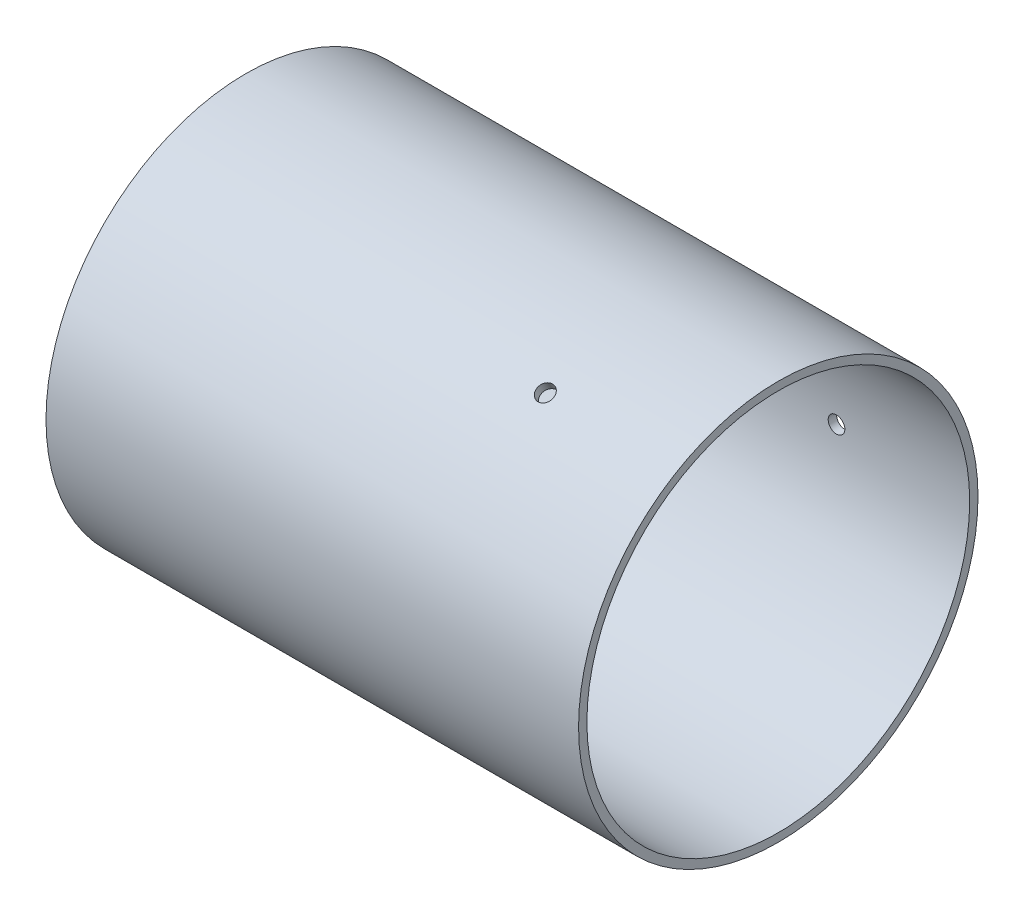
ISO-10303-21;
HEADER;
FILE_DESCRIPTION(('STEP AP214'),'2;1');
FILE_NAME('part.step','',(''),(''),'','','');
FILE_SCHEMA(('AUTOMOTIVE_DESIGN { 1 0 10303 214 1 1 1 1 }'));
ENDSEC;
DATA;
#1=APPLICATION_CONTEXT('core data for automotive mechanical design processes');
#2=APPLICATION_PROTOCOL_DEFINITION('international standard','automotive_design',2000,#1);
#3=PRODUCT_CONTEXT('',#1,'mechanical');
#4=PRODUCT('Part','Part','',(#3));
#5=PRODUCT_RELATED_PRODUCT_CATEGORY('part','',(#4));
#6=PRODUCT_DEFINITION_FORMATION('','',#4);
#7=PRODUCT_DEFINITION_CONTEXT('part definition',#1,'design');
#8=PRODUCT_DEFINITION('design','',#6,#7);
#9=PRODUCT_DEFINITION_SHAPE('','',#8);
#10=(LENGTH_UNIT() NAMED_UNIT(*) SI_UNIT(.MILLI.,.METRE.));
#11=(NAMED_UNIT(*) PLANE_ANGLE_UNIT() SI_UNIT($,.RADIAN.));
#12=(NAMED_UNIT(*) SI_UNIT($,.STERADIAN.) SOLID_ANGLE_UNIT());
#13=UNCERTAINTY_MEASURE_WITH_UNIT(LENGTH_MEASURE(1.E-05),#10,'distance_accuracy_value','');
#14=(GEOMETRIC_REPRESENTATION_CONTEXT(3) GLOBAL_UNCERTAINTY_ASSIGNED_CONTEXT((#13)) GLOBAL_UNIT_ASSIGNED_CONTEXT((#10,
#11,#12)) REPRESENTATION_CONTEXT('',''));
#15=CARTESIAN_POINT('',(0.,0.,0.));
#16=DIRECTION('',(0.,0.,1.));
#17=DIRECTION('',(1.,0.,0.));
#18=AXIS2_PLACEMENT_3D('',#15,#16,#17);
#19=CARTESIAN_POINT('',(101.6,0.,0.));
#20=DIRECTION('',(1.,0.,0.));
#21=DIRECTION('',(0.,0.,-1.));
#22=AXIS2_PLACEMENT_3D('',#19,#20,#21);
#23=PLANE('',#22);
#24=CARTESIAN_POINT('',(101.6,0.,0.));
#25=DIRECTION('',(1.,0.,0.));
#26=DIRECTION('',(0.,0.,-1.));
#27=AXIS2_PLACEMENT_3D('',#24,#25,#26);
#28=CIRCLE('',#27,38.1);
#29=CARTESIAN_POINT('',(101.6,0.,-38.1));
#30=VERTEX_POINT('',#29);
#31=EDGE_CURVE('E10',#30,#30,#28,.T.);
#32=ORIENTED_EDGE('',*,*,#31,.T.);
#33=EDGE_LOOP('',(#32));
#34=FACE_BOUND('',#33,.T.);
#35=CARTESIAN_POINT('',(101.6,0.,0.));
#36=DIRECTION('',(1.,0.,0.));
#37=DIRECTION('',(0.,0.,-1.));
#38=AXIS2_PLACEMENT_3D('',#35,#36,#37);
#39=CIRCLE('',#38,36.5125);
#40=CARTESIAN_POINT('',(101.6,0.,-36.5125));
#41=VERTEX_POINT('',#40);
#42=EDGE_CURVE('E47',#41,#41,#39,.T.);
#43=ORIENTED_EDGE('',*,*,#42,.F.);
#44=EDGE_LOOP('',(#43));
#45=FACE_BOUND('',#44,.T.);
#46=ADVANCED_FACE('F29',(#34,#45),#23,.T.);
#47=CARTESIAN_POINT('',(0.,0.,0.));
#48=DIRECTION('',(1.,0.,0.));
#49=DIRECTION('',(0.,0.,-1.));
#50=AXIS2_PLACEMENT_3D('',#47,#48,#49);
#51=PLANE('',#50);
#52=CARTESIAN_POINT('',(0.,0.,0.));
#53=DIRECTION('',(1.,0.,0.));
#54=DIRECTION('',(0.,0.,-1.));
#55=AXIS2_PLACEMENT_3D('',#52,#53,#54);
#56=CIRCLE('',#55,38.1);
#57=CARTESIAN_POINT('',(0.,0.,-38.1));
#58=VERTEX_POINT('',#57);
#59=EDGE_CURVE('E42',#58,#58,#56,.T.);
#60=ORIENTED_EDGE('',*,*,#59,.F.);
#61=EDGE_LOOP('',(#60));
#62=FACE_BOUND('',#61,.T.);
#63=CARTESIAN_POINT('',(0.,0.,0.));
#64=DIRECTION('',(1.,0.,0.));
#65=DIRECTION('',(0.,0.,-1.));
#66=AXIS2_PLACEMENT_3D('',#63,#64,#65);
#67=CIRCLE('',#66,36.5125);
#68=CARTESIAN_POINT('',(0.,0.,-36.5125));
#69=VERTEX_POINT('',#68);
#70=EDGE_CURVE('E78',#69,#69,#67,.T.);
#71=ORIENTED_EDGE('',*,*,#70,.T.);
#72=EDGE_LOOP('',(#71));
#73=FACE_BOUND('',#72,.T.);
#74=ADVANCED_FACE('F89',(#62,#73),#51,.F.);
#75=CARTESIAN_POINT('',(101.6,0.,0.));
#76=DIRECTION('',(-1.,0.,0.));
#77=DIRECTION('',(0.,0.,1.));
#78=AXIS2_PLACEMENT_3D('',#75,#76,#77);
#79=CYLINDRICAL_SURFACE('',#78,38.1);
#80=CARTESIAN_POINT('',(76.2,-32.1731634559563,20.4082716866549));
#81=CARTESIAN_POINT('',(76.2891290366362,-32.1731658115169,20.4082684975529));
#82=CARTESIAN_POINT('',(76.378321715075,-32.1772031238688,20.4019075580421));
#83=CARTESIAN_POINT('',(76.5542478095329,-32.1932293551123,20.37660912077));
#84=CARTESIAN_POINT('',(76.6409781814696,-32.2052277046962,20.3576567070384));
#85=CARTESIAN_POINT('',(76.809405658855,-32.236765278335,20.3076791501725));
#86=CARTESIAN_POINT('',(76.8911052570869,-32.2563007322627,20.2766600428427));
#87=CARTESIAN_POINT('',(77.0471732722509,-32.3022495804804,20.203379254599));
#88=CARTESIAN_POINT('',(77.1215434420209,-32.3286613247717,20.1611202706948));
#89=CARTESIAN_POINT('',(77.2609195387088,-32.3875080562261,20.0664501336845));
#90=CARTESIAN_POINT('',(77.3259193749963,-32.4199469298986,20.0140324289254));
#91=CARTESIAN_POINT('',(77.4446579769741,-32.489781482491,19.9004656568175));
#92=CARTESIAN_POINT('',(77.4983962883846,-32.5271773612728,19.8393162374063));
#93=CARTESIAN_POINT('',(77.5931010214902,-32.6057472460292,19.7099205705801));
#94=CARTESIAN_POINT('',(77.6340630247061,-32.6469225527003,19.6416718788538));
#95=CARTESIAN_POINT('',(77.70202392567,-32.7317599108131,19.4999668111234));
#96=CARTESIAN_POINT('',(77.7290229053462,-32.7754219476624,19.4265104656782));
#97=CARTESIAN_POINT('',(77.7682761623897,-32.8638871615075,19.2764752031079));
#98=CARTESIAN_POINT('',(77.7805390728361,-32.9086896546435,19.1998981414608));
#99=CARTESIAN_POINT('',(77.789998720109,-32.9981497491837,19.0457358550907));
#100=CARTESIAN_POINT('',(77.7871955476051,-33.0428073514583,18.9681506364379));
#101=CARTESIAN_POINT('',(77.7666098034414,-33.1306896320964,18.8142301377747));
#102=CARTESIAN_POINT('',(77.7488365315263,-33.1739151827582,18.7378941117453));
#103=CARTESIAN_POINT('',(77.6988295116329,-33.2577898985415,18.5886187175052));
#104=CARTESIAN_POINT('',(77.6665957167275,-33.2984390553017,18.5156793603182));
#105=CARTESIAN_POINT('',(77.5885720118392,-33.3761139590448,18.3752948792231));
#106=CARTESIAN_POINT('',(77.5427778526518,-33.4131385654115,18.3078514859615));
#107=CARTESIAN_POINT('',(77.4389364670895,-33.482623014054,18.1804628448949));
#108=CARTESIAN_POINT('',(77.3808891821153,-33.5150828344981,18.1205176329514));
#109=CARTESIAN_POINT('',(77.254136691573,-33.5746778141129,18.0098576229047));
#110=CARTESIAN_POINT('',(77.1854234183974,-33.601808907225,17.9591498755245));
#111=CARTESIAN_POINT('',(77.0393178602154,-33.6500818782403,17.8685375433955));
#112=CARTESIAN_POINT('',(76.9619255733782,-33.6712237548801,17.8286329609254));
#113=CARTESIAN_POINT('',(76.8006541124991,-33.7070379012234,17.760829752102));
#114=CARTESIAN_POINT('',(76.7167748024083,-33.7217100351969,17.7329313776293));
#115=CARTESIAN_POINT('',(76.5449124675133,-33.7442566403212,17.6899897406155));
#116=CARTESIAN_POINT('',(76.4569294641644,-33.752131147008,17.6749464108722));
#117=CARTESIAN_POINT('',(76.2794281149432,-33.7609057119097,17.6581804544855));
#118=CARTESIAN_POINT('',(76.1899109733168,-33.7618110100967,17.6564478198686));
#119=CARTESIAN_POINT('',(76.0118201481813,-33.7566411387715,17.6663298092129));
#120=CARTESIAN_POINT('',(75.9232464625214,-33.7505659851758,17.6779444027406));
#121=CARTESIAN_POINT('',(75.7495884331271,-33.7315720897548,17.714159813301));
#122=CARTESIAN_POINT('',(75.6645028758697,-33.7186557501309,17.7387560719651));
#123=CARTESIAN_POINT('',(75.5001990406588,-33.6862673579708,17.800185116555));
#124=CARTESIAN_POINT('',(75.4209807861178,-33.6667952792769,17.8370179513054));
#125=CARTESIAN_POINT('',(75.2706083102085,-33.6217211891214,17.9218348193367));
#126=CARTESIAN_POINT('',(75.1994589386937,-33.5961155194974,17.9698255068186));
#127=CARTESIAN_POINT('',(75.0672926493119,-33.5393732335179,18.0755091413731));
#128=CARTESIAN_POINT('',(75.006275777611,-33.508236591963,18.1332021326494));
#129=CARTESIAN_POINT('',(74.896068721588,-33.4411557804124,18.2566159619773));
#130=CARTESIAN_POINT('',(74.8468858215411,-33.4052086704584,18.3223417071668));
#131=CARTESIAN_POINT('',(74.761792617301,-33.3294142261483,18.4598565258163));
#132=CARTESIAN_POINT('',(74.7258822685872,-33.2895669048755,18.531645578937));
#133=CARTESIAN_POINT('',(74.6683662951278,-33.2070152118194,18.6791669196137));
#134=CARTESIAN_POINT('',(74.6467559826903,-33.1643117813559,18.7548979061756));
#135=CARTESIAN_POINT('',(74.6184381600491,-33.0771848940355,18.9081359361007));
#136=CARTESIAN_POINT('',(74.6117305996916,-33.0327614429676,18.9856429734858));
#137=CARTESIAN_POINT('',(74.6134092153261,-32.9434712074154,19.1401583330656));
#138=CARTESIAN_POINT('',(74.6217839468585,-32.8986047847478,19.2171669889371));
#139=CARTESIAN_POINT('',(74.6533658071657,-32.8096947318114,19.3685735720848));
#140=CARTESIAN_POINT('',(74.6765729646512,-32.7656511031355,19.4429714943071));
#141=CARTESIAN_POINT('',(74.737158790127,-32.6797042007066,19.5870870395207));
#142=CARTESIAN_POINT('',(74.7745376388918,-32.637800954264,19.6568046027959));
#143=CARTESIAN_POINT('',(74.8624033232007,-32.5574276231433,19.7896422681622));
#144=CARTESIAN_POINT('',(74.9128897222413,-32.5189574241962,19.8527625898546));
#145=CARTESIAN_POINT('',(75.02557657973,-32.4466410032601,19.9707357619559));
#146=CARTESIAN_POINT('',(75.0877846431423,-32.4127978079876,20.0255832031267));
#147=CARTESIAN_POINT('',(75.2221509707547,-32.3508533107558,20.1255001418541));
#148=CARTESIAN_POINT('',(75.294311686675,-32.322753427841,20.1705672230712));
#149=CARTESIAN_POINT('',(75.4465780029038,-32.2732154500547,20.2497346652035));
#150=CARTESIAN_POINT('',(75.5266899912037,-32.2517827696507,20.283826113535));
#151=CARTESIAN_POINT('',(75.6924784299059,-32.2163508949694,20.3400553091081));
#152=CARTESIAN_POINT('',(75.7781481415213,-32.2023428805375,20.3622072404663));
#153=CARTESIAN_POINT('',(75.9202953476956,-32.1859297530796,20.388135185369));
#154=CARTESIAN_POINT('',(75.9758511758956,-32.1811494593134,20.395677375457));
#155=CARTESIAN_POINT('',(76.0875962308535,-32.1747655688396,20.4057466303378));
#156=CARTESIAN_POINT('',(76.1437854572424,-32.1731619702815,20.4082736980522));
#157=CARTESIAN_POINT('',(76.2,-32.1731634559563,20.4082716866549));
#158=B_SPLINE_CURVE_WITH_KNOTS('',3,(#80,#81,#82,#83,#84,#85,#86,#87,#88,#89,#90,#91,#92,#93,
#94,#95,#96,#97,#98,#99,#100,#101,#102,#103,#104,#105,#106,#107,#108,#109,#110,#111,#112,#113,
#114,#115,#116,#117,#118,#119,#120,#121,#122,#123,#124,#125,#126,#127,#128,#129,#130,#131,#132,
#133,#134,#135,#136,#137,#138,#139,#140,#141,#142,#143,#144,#145,#146,#147,#148,#149,#150,#151,
#152,#153,#154,#155,#156,#157),.UNSPECIFIED.,.T.,.F.,(4,2,2,2,2,2,2,2,2,2,2,2,2,2,2,2,2,2,2,2,2,
2,2,2,2,2,2,2,2,2,2,2,2,2,2,2,2,2,4),(0.,0.267181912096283,0.534680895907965,0.802046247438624,
1.06934750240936,1.33682172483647,1.60430673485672,1.87188414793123,2.13945999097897,
2.40687899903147,2.67429639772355,2.94154779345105,3.20880005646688,3.47613615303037,
3.74347352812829,4.01101410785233,4.27855474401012,4.5461009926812,4.81364584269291,
5.08098951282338,5.34833257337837,5.61558182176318,5.88283213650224,6.15024224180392,
6.41765356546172,6.68522907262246,6.95280368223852,7.22029053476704,7.48777648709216,
7.75505955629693,8.02234314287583,8.28963013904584,8.55690823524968,8.82436034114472,
9.09187844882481,9.35961324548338,9.62702926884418,9.7955435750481,9.96405778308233),.UNSPECIFIED.);
#159=CARTESIAN_POINT('',(76.2,-32.1731634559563,20.4082716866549));
#160=VERTEX_POINT('',#159);
#161=EDGE_CURVE('E118',#160,#160,#158,.T.);
#162=ORIENTED_EDGE('',*,*,#161,.T.);
#163=EDGE_LOOP('',(#162));
#164=FACE_BOUND('',#163,.T.);
#165=CARTESIAN_POINT('',(76.2,33.760663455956,17.6586410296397));
#166=CARTESIAN_POINT('',(76.2891290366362,33.760661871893,17.658644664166));
#167=CARTESIAN_POINT('',(76.378321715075,33.7571717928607,17.6653215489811));
#168=CARTESIAN_POINT('',(76.5542478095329,33.7432758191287,17.691849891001));
#169=CARTESIAN_POINT('',(76.6409781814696,33.7328617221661,17.7117169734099));
#170=CARTESIAN_POINT('',(76.809405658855,33.7053486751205,17.7640180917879));
#171=CARTESIAN_POINT('',(76.8911052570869,33.688253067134,17.7964458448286));
#172=CARTESIAN_POINT('',(77.047173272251,33.6477644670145,17.8728791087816));
#173=CARTESIAN_POINT('',(77.1215434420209,33.624372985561,17.9168818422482));
#174=CARTESIAN_POINT('',(77.2609195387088,33.5718096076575,18.0151796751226));
#175=CARTESIAN_POINT('',(77.3259193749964,33.5426339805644,18.0694814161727));
#176=CARTESIAN_POINT('',(77.4446579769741,33.4791995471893,18.1867432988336));
#177=CARTESIAN_POINT('',(77.4983962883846,33.4449405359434,18.249703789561));
#178=CARTESIAN_POINT('',(77.5931010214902,33.3721655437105,18.3824451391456));
#179=CARTESIAN_POINT('',(77.6340630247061,33.333648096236,18.4522283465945));
#180=CARTESIAN_POINT('',(77.70202392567,33.253346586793,18.5965521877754));
#181=CARTESIAN_POINT('',(77.7290229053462,33.2115625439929,18.6710927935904));
#182=CARTESIAN_POINT('',(77.7682761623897,33.1258608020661,18.8227235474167));
#183=CARTESIAN_POINT('',(77.7805390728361,33.0819443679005,18.8998121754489));
#184=CARTESIAN_POINT('',(77.789998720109,32.9931659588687,19.0543680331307));
#185=CARTESIAN_POINT('',(77.7871955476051,32.9483039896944,19.131835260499));
#186=CARTESIAN_POINT('',(77.7666098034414,32.858946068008,19.2849037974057));
#187=CARTESIAN_POINT('',(77.7488365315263,32.8144499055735,19.3605062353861));
#188=CARTESIAN_POINT('',(77.6988295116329,32.7271109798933,19.5077815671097));
#189=CARTESIAN_POINT('',(77.6665957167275,32.6842682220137,19.5794544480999));
#190=CARTESIAN_POINT('',(77.5885720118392,32.6015291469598,19.7169151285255));
#191=CARTESIAN_POINT('',(77.5427778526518,32.5616337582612,19.782701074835));
#192=CARTESIAN_POINT('',(77.4389364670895,32.4860541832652,19.9065706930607));
#193=CARTESIAN_POINT('',(77.3808891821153,32.4503700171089,19.9646543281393));
#194=CARTESIAN_POINT('',(77.254136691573,32.3843331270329,20.071595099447));
#195=CARTESIAN_POINT('',(77.1854234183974,32.353984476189,20.1204451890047));
#196=CARTESIAN_POINT('',(77.0393178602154,32.2996483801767,20.2075569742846));
#197=CARTESIAN_POINT('',(76.9619255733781,32.2756609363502,20.2458186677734));
#198=CARTESIAN_POINT('',(76.8006541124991,32.2348487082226,20.3107362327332));
#199=CARTESIAN_POINT('',(76.7167748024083,32.2180240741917,20.3373918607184));
#200=CARTESIAN_POINT('',(76.5449124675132,32.1921088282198,20.378388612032));
#201=CARTESIAN_POINT('',(76.4569294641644,32.183018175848,20.3927297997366));
#202=CARTESIAN_POINT('',(76.2794281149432,32.1728857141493,20.4087117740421));
#203=CARTESIAN_POINT('',(76.1899109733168,32.171837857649,20.4103621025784));
#204=CARTESIAN_POINT('',(76.0118201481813,32.1778109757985,20.4009438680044));
#205=CARTESIAN_POINT('',(75.9232464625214,32.1848319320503,20.3898753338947));
#206=CARTESIAN_POINT('',(75.7495884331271,32.2066984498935,20.3553184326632));
#207=CARTESIAN_POINT('',(75.6645028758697,32.2215412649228,20.3318344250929));
#208=CARTESIAN_POINT('',(75.5001990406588,32.2585461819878,20.2730707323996));
#209=CARTESIAN_POINT('',(75.4209807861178,32.280708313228,20.2377910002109));
#210=CARTESIAN_POINT('',(75.2706083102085,32.3316248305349,20.1563472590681));
#211=CARTESIAN_POINT('',(75.1994589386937,32.3603831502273,20.110176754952));
#212=CARTESIAN_POINT('',(75.0672926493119,32.4235367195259,20.0081946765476));
#213=CARTESIAN_POINT('',(75.006275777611,32.4579319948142,19.9523830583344));
#214=CARTESIAN_POINT('',(74.896068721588,32.5312711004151,19.8325824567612));
#215=CARTESIAN_POINT('',(74.8468858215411,32.5702177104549,19.7685884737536));
#216=CARTESIAN_POINT('',(74.761792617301,32.6514118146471,19.6341911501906));
#217=CARTESIAN_POINT('',(74.7258822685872,32.6936592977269,19.5637878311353));
#218=CARTESIAN_POINT('',(74.6683662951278,32.7801406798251,19.4185352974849));
#219=CARTESIAN_POINT('',(74.6467559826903,32.8243739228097,19.3436875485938));
#220=CARTESIAN_POINT('',(74.6184381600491,32.9135185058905,19.1916144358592));
#221=CARTESIAN_POINT('',(74.6117305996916,32.9584298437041,19.114389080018));
#222=CARTESIAN_POINT('',(74.6134092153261,33.047598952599,18.95980378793));
#223=CARTESIAN_POINT('',(74.6217839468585,33.0918571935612,18.8824439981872));
#224=CARTESIAN_POINT('',(74.6533658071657,33.1785241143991,18.7297423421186));
#225=CARTESIAN_POINT('',(74.6765729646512,33.2209327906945,18.6544004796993));
#226=CARTESIAN_POINT('',(74.737158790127,33.3027670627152,18.5079105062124));
#227=CARTESIAN_POINT('',(74.7745376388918,33.3421926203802,18.4367624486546));
#228=CARTESIAN_POINT('',(74.8624033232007,33.4170467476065,18.300738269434));
#229=CARTESIAN_POINT('',(74.9128897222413,33.4524754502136,18.235861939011));
#230=CARTESIAN_POINT('',(75.02557657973,33.5184850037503,18.1142474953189));
#231=CARTESIAN_POINT('',(75.0877846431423,33.5490626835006,18.0575147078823));
#232=CARTESIAN_POINT('',(75.2221509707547,33.604621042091,17.9539107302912));
#233=CARTESIAN_POINT('',(75.294311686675,33.629600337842,17.9070419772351));
#234=CARTESIAN_POINT('',(75.4465780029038,33.673392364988,17.824557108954));
#235=CARTESIAN_POINT('',(75.5266899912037,33.6922000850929,17.7889501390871));
#236=CARTESIAN_POINT('',(75.6924784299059,33.7231800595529,17.7301506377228));
#237=CARTESIAN_POINT('',(75.7781481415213,33.7353601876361,17.7069433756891));
#238=CARTESIAN_POINT('',(75.9202953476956,33.7496078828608,17.6797652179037));
#239=CARTESIAN_POINT('',(75.9758511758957,33.7537494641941,17.6718542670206));
#240=CARTESIAN_POINT('',(76.0875962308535,33.7592777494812,17.6612910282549));
#241=CARTESIAN_POINT('',(76.1437854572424,33.7606644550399,17.6586387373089));
#242=CARTESIAN_POINT('',(76.2,33.760663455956,17.6586410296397));
#243=B_SPLINE_CURVE_WITH_KNOTS('',3,(#165,#166,#167,#168,#169,#170,#171,#172,#173,#174,#175,
#176,#177,#178,#179,#180,#181,#182,#183,#184,#185,#186,#187,#188,#189,#190,#191,#192,#193,#194,
#195,#196,#197,#198,#199,#200,#201,#202,#203,#204,#205,#206,#207,#208,#209,#210,#211,#212,#213,
#214,#215,#216,#217,#218,#219,#220,#221,#222,#223,#224,#225,#226,#227,#228,#229,#230,#231,#232,
#233,#234,#235,#236,#237,#238,#239,#240,#241,#242),.UNSPECIFIED.,.T.,.F.,(4,2,2,2,2,2,2,2,2,2,2,
2,2,2,2,2,2,2,2,2,2,2,2,2,2,2,2,2,2,2,2,2,2,2,2,2,2,2,4),(0.,0.267181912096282,
0.534680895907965,0.802046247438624,1.06934750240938,1.33682172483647,1.60430673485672,
1.87188414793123,2.13945999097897,2.40687899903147,2.67429639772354,2.94154779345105,
3.20880005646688,3.47613615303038,3.74347352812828,4.01101410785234,4.27855474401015,
4.54610099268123,4.81364584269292,5.0809895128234,5.34833257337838,5.61558182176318,
5.88283213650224,6.15024224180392,6.41765356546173,6.68522907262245,6.95280368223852,
7.22029053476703,7.48777648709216,7.75505955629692,8.02234314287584,8.28963013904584,
8.55690823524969,8.82436034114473,9.09187844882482,9.35961324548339,9.6270292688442,
9.7955435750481,9.96405778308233),.UNSPECIFIED.);
#244=CARTESIAN_POINT('',(76.2,33.760663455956,17.6586410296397));
#245=VERTEX_POINT('',#244);
#246=EDGE_CURVE('E57',#245,#245,#243,.T.);
#247=ORIENTED_EDGE('',*,*,#246,.T.);
#248=EDGE_LOOP('',(#247));
#249=FACE_BOUND('',#248,.T.);
#250=CARTESIAN_POINT('',(77.7875,0.,-38.1));
#251=CARTESIAN_POINT('',(77.7874960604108,0.0891290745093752,-38.0999995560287));
#252=CARTESIAN_POINT('',(77.7799686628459,0.178321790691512,-38.0996838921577));
#253=CARTESIAN_POINT('',(77.7500464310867,0.354247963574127,-38.0984549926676));
#254=CARTESIAN_POINT('',(77.7276339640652,0.44097837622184,-38.097541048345));
#255=CARTESIAN_POINT('',(77.6685832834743,0.609405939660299,-38.0952190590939));
#256=CARTESIAN_POINT('',(77.6319521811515,0.691105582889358,-38.093811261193));
#257=CARTESIAN_POINT('',(77.54551463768,0.847173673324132,-38.090660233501));
#258=CARTESIAN_POINT('',(77.4957113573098,0.921543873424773,-38.0889170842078));
#259=CARTESIAN_POINT('',(77.3843011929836,1.06091993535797,-38.0852900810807));
#260=CARTESIAN_POINT('',(77.3226867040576,1.12591971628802,-38.0834061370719));
#261=CARTESIAN_POINT('',(77.1894177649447,1.24465821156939,-38.0797106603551));
#262=CARTESIAN_POINT('',(77.1177629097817,1.29839647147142,-38.0778991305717));
#263=CARTESIAN_POINT('',(76.9664180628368,1.39310115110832,-38.0745521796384));
#264=CARTESIAN_POINT('',(76.8867252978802,1.43406314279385,-38.0730168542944));
#265=CARTESIAN_POINT('',(76.721586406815,1.50202401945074,-38.0703964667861));
#266=CARTESIAN_POINT('',(76.6361403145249,1.52902298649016,-38.0693114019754));
#267=CARTESIAN_POINT('',(76.4619733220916,1.56827621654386,-38.0677146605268));
#268=CARTESIAN_POINT('',(76.373254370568,1.58053911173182,-38.0672026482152));
#269=CARTESIAN_POINT('',(76.1950158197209,1.5899987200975,-38.0668087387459));
#270=CARTESIAN_POINT('',(76.1054962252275,1.58719552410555,-38.0669268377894));
#271=CARTESIAN_POINT('',(75.9282561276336,1.56660974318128,-38.0677795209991));
#272=CARTESIAN_POINT('',(75.8405345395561,1.54883648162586,-38.0685137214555));
#273=CARTESIAN_POINT('',(75.6693211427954,1.49882952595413,-38.0705152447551));
#274=CARTESIAN_POINT('',(75.5858293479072,1.4665957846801,-38.0717825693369));
#275=CARTESIAN_POINT('',(75.4254155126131,1.38857218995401,-38.0747079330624));
#276=CARTESIAN_POINT('',(75.3484955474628,1.34277807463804,-38.076366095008));
#277=CARTESIAN_POINT('',(75.2034315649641,1.2389367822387,-38.079886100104));
#278=CARTESIAN_POINT('',(75.1352875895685,1.18088954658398,-38.0817479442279));
#279=CARTESIAN_POINT('',(75.009655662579,1.05413709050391,-38.0854671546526));
#280=CARTESIAN_POINT('',(74.9521758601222,0.985423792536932,-38.0873245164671));
#281=CARTESIAN_POINT('',(74.8495666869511,0.83931816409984,-38.0908240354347));
#282=CARTESIAN_POINT('',(74.804437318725,0.761925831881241,-38.0924661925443));
#283=CARTESIAN_POINT('',(74.7278109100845,0.600654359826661,-38.0953502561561));
#284=CARTESIAN_POINT('',(74.6963141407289,0.516775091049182,-38.0965921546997));
#285=CARTESIAN_POINT('',(74.6478522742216,0.344912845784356,-38.098535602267));
#286=CARTESIAN_POINT('',(74.6308871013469,0.256929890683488,-38.0992371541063));
#287=CARTESIAN_POINT('',(74.6119800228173,0.0794285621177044,-38.1000204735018));
#288=CARTESIAN_POINT('',(74.6100268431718,-0.0100886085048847,-38.100102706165));
#289=CARTESIAN_POINT('',(74.6211697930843,-0.188179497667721,-38.0996393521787));
#290=CARTESIAN_POINT('',(74.6342658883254,-0.276753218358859,-38.0990937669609));
#291=CARTESIAN_POINT('',(74.6751263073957,-0.450411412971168,-38.0974365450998));
#292=CARTESIAN_POINT('',(74.7028854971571,-0.535497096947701,-38.0963251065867));
#293=CARTESIAN_POINT('',(74.7722789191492,-0.69980117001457,-38.0936613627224));
#294=CARTESIAN_POINT('',(74.8139132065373,-0.779019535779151,-38.0921090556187));
#295=CARTESIAN_POINT('',(74.9099039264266,-0.929392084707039,-38.0887371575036));
#296=CARTESIAN_POINT('',(74.964267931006,-1.00054143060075,-38.0869174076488));
#297=CARTESIAN_POINT('',(75.0841638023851,-1.13270766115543,-38.0832161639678));
#298=CARTESIAN_POINT('',(75.1496957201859,-1.19372449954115,-38.0813346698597));
#299=CARTESIAN_POINT('',(75.290115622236,-1.30393148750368,-38.0777206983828));
#300=CARTESIAN_POINT('',(75.3650093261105,-1.35311435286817,-38.0759883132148));
#301=CARTESIAN_POINT('',(75.5219978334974,-1.43820749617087,-38.072869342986));
#302=CARTESIAN_POINT('',(75.6040926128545,-1.47411781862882,-38.0714827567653));
#303=CARTESIAN_POINT('',(75.7731257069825,-1.53163377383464,-38.0692123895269));
#304=CARTESIAN_POINT('',(75.8600624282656,-1.55324408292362,-38.0683284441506));
#305=CARTESIAN_POINT('',(76.0363339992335,-1.58156188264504,-38.0671625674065));
#306=CARTESIAN_POINT('',(76.125668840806,-1.58826942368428,-38.0668806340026));
#307=CARTESIAN_POINT('',(76.304128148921,-1.58659075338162,-38.0669506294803));
#308=CARTESIAN_POINT('',(76.3932527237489,-1.57821600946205,-38.0673020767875));
#309=CARTESIAN_POINT('',(76.5688295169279,-1.54663415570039,-38.0685982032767));
#310=CARTESIAN_POINT('',(76.655281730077,-1.52342701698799,-38.0695428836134));
#311=CARTESIAN_POINT('',(76.8230627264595,-1.46284126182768,-38.0719188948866));
#312=CARTESIAN_POINT('',(76.9043914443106,-1.42546246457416,-38.073350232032));
#313=CARTESIAN_POINT('',(77.0596187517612,-1.33759690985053,-38.0765381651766));
#314=CARTESIAN_POINT('',(77.1335175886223,-1.28711058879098,-38.0782947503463));
#315=CARTESIAN_POINT('',(77.2718435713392,-1.17442381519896,-38.0819366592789));
#316=CARTESIAN_POINT('',(77.3362645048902,-1.11221574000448,-38.0838220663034));
#317=CARTESIAN_POINT('',(77.4537674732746,-0.977849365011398,-38.0875086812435));
#318=CARTESIAN_POINT('',(77.5068467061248,-0.905688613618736,-38.0893098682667));
#319=CARTESIAN_POINT('',(77.6001767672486,-0.753422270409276,-38.0926259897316));
#320=CARTESIAN_POINT('',(77.6404171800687,-0.673310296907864,-38.0941406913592));
#321=CARTESIAN_POINT('',(77.7068290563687,-0.507521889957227,-38.096709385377));
#322=CARTESIAN_POINT('',(77.733017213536,-0.421852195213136,-38.0977639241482));
#323=CARTESIAN_POINT('',(77.7636780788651,-0.27970494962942,-38.09901314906));
#324=CARTESIAN_POINT('',(77.772599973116,-0.224149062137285,-38.0993816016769));
#325=CARTESIAN_POINT('',(77.7845121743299,-0.112403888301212,-38.0998751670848));
#326=CARTESIAN_POINT('',(77.7875024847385,-0.0562146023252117,-38.1000002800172));
#327=CARTESIAN_POINT('',(77.7875,0.,-38.1));
#328=B_SPLINE_CURVE_WITH_KNOTS('',3,(#250,#251,#252,#253,#254,#255,#256,#257,#258,#259,#260,
#261,#262,#263,#264,#265,#266,#267,#268,#269,#270,#271,#272,#273,#274,#275,#276,#277,#278,#279,
#280,#281,#282,#283,#284,#285,#286,#287,#288,#289,#290,#291,#292,#293,#294,#295,#296,#297,#298,
#299,#300,#301,#302,#303,#304,#305,#306,#307,#308,#309,#310,#311,#312,#313,#314,#315,#316,#317,
#318,#319,#320,#321,#322,#323,#324,#325,#326,#327),.UNSPECIFIED.,.T.,.F.,(4,2,2,2,2,2,2,2,2,2,2,
2,2,2,2,2,2,2,2,2,2,2,2,2,2,2,2,2,2,2,2,2,2,2,2,2,2,2,4),(0.,0.267182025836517,
0.534681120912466,0.80204660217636,1.06934798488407,1.33682205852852,1.60430692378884,
1.87188439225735,2.13946028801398,2.40687936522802,2.67429683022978,2.94154787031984,
3.20879978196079,3.47613577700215,3.74347304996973,4.01101377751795,4.27855455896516,
4.5461006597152,4.81364536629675,5.08098912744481,5.34833227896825,5.61558188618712,
5.88283255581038,6.15024260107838,6.41765386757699,6.68522931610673,6.95280386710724,
7.22029087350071,7.48777697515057,7.75505978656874,8.02234311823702,8.28962986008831,
8.55690770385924,8.82435996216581,9.09187821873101,9.3596129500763,9.62702891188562,
9.7955433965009,9.96405778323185),.UNSPECIFIED.);
#329=CARTESIAN_POINT('',(77.7875,0.,-38.1));
#330=VERTEX_POINT('',#329);
#331=EDGE_CURVE('E56',#330,#330,#328,.T.);
#332=ORIENTED_EDGE('',*,*,#331,.T.);
#333=EDGE_LOOP('',(#332));
#334=FACE_BOUND('',#333,.T.);
#335=ORIENTED_EDGE('',*,*,#31,.F.);
#336=EDGE_LOOP('',(#335));
#337=FACE_BOUND('',#336,.T.);
#338=ORIENTED_EDGE('',*,*,#59,.T.);
#339=EDGE_LOOP('',(#338));
#340=FACE_BOUND('',#339,.T.);
#341=ADVANCED_FACE('F31',(#164,#249,#334,#337,#340),#79,.T.);
#342=CARTESIAN_POINT('',(101.6,0.,0.));
#343=DIRECTION('',(-1.,0.,0.));
#344=DIRECTION('',(0.,0.,1.));
#345=AXIS2_PLACEMENT_3D('',#342,#343,#344);
#346=CYLINDRICAL_SURFACE('',#345,36.5125);
#347=CARTESIAN_POINT('',(76.2,-30.7971011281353,19.6138017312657));
#348=CARTESIAN_POINT('',(76.2891253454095,-30.7971034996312,19.6137985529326));
#349=CARTESIAN_POINT('',(76.3783142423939,-30.8011523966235,19.6074450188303));
#350=CARTESIAN_POINT('',(76.5542326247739,-30.8172236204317,19.5821755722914));
#351=CARTESIAN_POINT('',(76.640959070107,-30.829255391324,19.5632447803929));
#352=CARTESIAN_POINT('',(76.8093786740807,-30.860877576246,19.5133226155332));
#353=CARTESIAN_POINT('',(76.891074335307,-30.8804641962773,19.4823372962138));
#354=CARTESIAN_POINT('',(77.0471352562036,-30.9265271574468,19.4091327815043));
#355=CARTESIAN_POINT('',(77.1215022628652,-30.9530018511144,19.3669162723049));
#356=CARTESIAN_POINT('',(77.2608768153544,-31.0119805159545,19.272333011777));
#357=CARTESIAN_POINT('',(77.3258778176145,-31.0444886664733,19.2199592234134));
#358=CARTESIAN_POINT('',(77.444619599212,-31.1144591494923,19.1064785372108));
#359=CARTESIAN_POINT('',(77.4983599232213,-31.1519216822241,19.0453712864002));
#360=CARTESIAN_POINT('',(77.5930711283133,-31.2306161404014,18.9160512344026));
#361=CARTESIAN_POINT('',(77.6340371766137,-31.2718494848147,18.8478357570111));
#362=CARTESIAN_POINT('',(77.7020058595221,-31.3567866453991,18.7061861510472));
#363=CARTESIAN_POINT('',(77.7290085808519,-31.4004904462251,18.6327520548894));
#364=CARTESIAN_POINT('',(77.7682675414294,-31.489015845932,18.4827517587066));
#365=CARTESIAN_POINT('',(77.7805331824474,-31.5338367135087,18.4061875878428));
#366=CARTESIAN_POINT('',(77.78999880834,-31.6233101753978,18.2520368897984));
#367=CARTESIAN_POINT('',(77.7871988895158,-31.6679627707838,18.1744503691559));
#368=CARTESIAN_POINT('',(77.7666207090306,-31.75580959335,18.0205178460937));
#369=CARTESIAN_POINT('',(77.74885257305,-31.7990047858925,17.9441710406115));
#370=CARTESIAN_POINT('',(77.6988580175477,-31.8827991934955,17.7948617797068));
#371=CARTESIAN_POINT('',(77.6666315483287,-31.9233983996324,17.7218993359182));
#372=CARTESIAN_POINT('',(77.5886235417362,-32.0009604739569,17.5814569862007));
#373=CARTESIAN_POINT('',(77.5428373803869,-32.0379220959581,17.5139789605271));
#374=CARTESIAN_POINT('',(77.4390130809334,-32.1072736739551,17.386515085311));
#375=CARTESIAN_POINT('',(77.3809748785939,-32.1396636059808,17.3265292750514));
#376=CARTESIAN_POINT('',(77.2542367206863,-32.1991219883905,17.2157823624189));
#377=CARTESIAN_POINT('',(77.185527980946,-32.2261860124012,17.1650289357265));
#378=CARTESIAN_POINT('',(77.0394300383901,-32.2743332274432,17.0743291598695));
#379=CARTESIAN_POINT('',(76.9620408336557,-32.2954164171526,17.0343828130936));
#380=CARTESIAN_POINT('',(76.8007735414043,-32.3311284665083,16.9665042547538));
#381=CARTESIAN_POINT('',(76.7168953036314,-32.345757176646,16.9385723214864));
#382=CARTESIAN_POINT('',(76.5450332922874,-32.3682372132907,16.8955754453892));
#383=CARTESIAN_POINT('',(76.4570495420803,-32.3760885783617,16.8805104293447));
#384=CARTESIAN_POINT('',(76.2795511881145,-32.3848396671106,16.8637157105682));
#385=CARTESIAN_POINT('',(76.1900378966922,-32.3857450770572,16.8619750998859));
#386=CARTESIAN_POINT('',(76.0119536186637,-32.3805996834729,16.8718537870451));
#387=CARTESIAN_POINT('',(75.9233826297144,-32.374548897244,16.8834730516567));
#388=CARTESIAN_POINT('',(75.7497315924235,-32.355625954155,16.9197085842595));
#389=CARTESIAN_POINT('',(75.6646502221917,-32.3427564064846,16.944319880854));
#390=CARTESIAN_POINT('',(75.5003528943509,-32.3104791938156,17.005786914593));
#391=CARTESIAN_POINT('',(75.4211369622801,-32.2910715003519,17.0426427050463));
#392=CARTESIAN_POINT('',(75.2707625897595,-32.246135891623,17.1275122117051));
#393=CARTESIAN_POINT('',(75.1996094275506,-32.2206040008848,17.1755331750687));
#394=CARTESIAN_POINT('',(75.0674334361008,-32.1640115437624,17.2812790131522));
#395=CARTESIAN_POINT('',(75.00641065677,-32.1329509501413,17.3390039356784));
#396=CARTESIAN_POINT('',(74.8961864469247,-32.0660143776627,17.4624827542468));
#397=CARTESIAN_POINT('',(74.8469929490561,-32.0301351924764,17.528241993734));
#398=CARTESIAN_POINT('',(74.7618779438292,-31.954462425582,17.6658184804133));
#399=CARTESIAN_POINT('',(74.7259563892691,-31.9146688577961,17.737635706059));
#400=CARTESIAN_POINT('',(74.6684188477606,-31.8322056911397,17.8852026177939));
#401=CARTESIAN_POINT('',(74.6467977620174,-31.7895371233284,17.960950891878));
#402=CARTESIAN_POINT('',(74.6184581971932,-31.7024562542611,18.1142123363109));
#403=CARTESIAN_POINT('',(74.6117396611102,-31.6580439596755,18.1917254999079));
#404=CARTESIAN_POINT('',(74.6133964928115,-31.5687542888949,18.3462356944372));
#405=CARTESIAN_POINT('',(74.6217594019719,-31.5238773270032,18.4232330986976));
#406=CARTESIAN_POINT('',(74.6533160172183,-31.4349229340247,18.5746059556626));
#407=CARTESIAN_POINT('',(74.6765097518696,-31.3908455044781,18.6489814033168));
#408=CARTESIAN_POINT('',(74.7370672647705,-31.3048115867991,18.7930432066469));
#409=CARTESIAN_POINT('',(74.7744312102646,-31.2628551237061,18.8627295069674));
#410=CARTESIAN_POINT('',(74.8622659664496,-31.1823616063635,18.9954998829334));
#411=CARTESIAN_POINT('',(74.9127363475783,-31.1438244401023,19.058584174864));
#412=CARTESIAN_POINT('',(75.0253944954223,-31.0713649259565,19.1764892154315));
#413=CARTESIAN_POINT('',(75.0875906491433,-31.0374459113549,19.2313039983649));
#414=CARTESIAN_POINT('',(75.2219349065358,-30.9753516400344,19.3311591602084));
#415=CARTESIAN_POINT('',(75.2940854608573,-30.9471778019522,19.3761971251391));
#416=CARTESIAN_POINT('',(75.4463362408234,-30.8975007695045,19.455315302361));
#417=CARTESIAN_POINT('',(75.526443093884,-30.8760031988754,19.4893862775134));
#418=CARTESIAN_POINT('',(75.6922245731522,-30.8404585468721,19.5455848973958));
#419=CARTESIAN_POINT('',(75.7778924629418,-30.8264026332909,19.5677267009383));
#420=CARTESIAN_POINT('',(75.9200800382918,-30.8099245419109,19.5936555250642));
#421=CARTESIAN_POINT('',(75.9756779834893,-30.8051229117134,19.6012013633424));
#422=CARTESIAN_POINT('',(76.0875088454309,-30.798710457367,19.6112754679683));
#423=CARTESIAN_POINT('',(76.1437417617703,-30.7970996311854,19.6138037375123));
#424=CARTESIAN_POINT('',(76.2,-30.7971011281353,19.6138017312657));
#425=B_SPLINE_CURVE_WITH_KNOTS('',3,(#347,#348,#349,#350,#351,#352,#353,#354,#355,#356,#357,
#358,#359,#360,#361,#362,#363,#364,#365,#366,#367,#368,#369,#370,#371,#372,#373,#374,#375,#376,
#377,#378,#379,#380,#381,#382,#383,#384,#385,#386,#387,#388,#389,#390,#391,#392,#393,#394,#395,
#396,#397,#398,#399,#400,#401,#402,#403,#404,#405,#406,#407,#408,#409,#410,#411,#412,#413,#414,
#415,#416,#417,#418,#419,#420,#421,#422,#423,#424),.UNSPECIFIED.,.T.,.F.,(4,2,2,2,2,2,2,2,2,2,2,
2,2,2,2,2,2,2,2,2,2,2,2,2,2,2,2,2,2,2,2,2,2,2,2,2,2,2,4),(0.,0.267170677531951,
0.534657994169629,0.802011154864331,1.06930042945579,1.33677554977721,1.60426148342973,
1.87184849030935,2.13943383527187,2.40684837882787,2.67426121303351,2.94149329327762,
3.20872629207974,3.4760505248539,3.74337615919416,4.01092303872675,4.27846997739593,
4.5460231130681,4.81357472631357,5.08090728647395,5.34823918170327,5.61546885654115,
5.88269969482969,6.15010447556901,6.41751057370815,6.68509549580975,6.95267946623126,
7.22016797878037,7.48765546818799,7.75492209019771,8.02218922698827,8.28945951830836,
8.55672105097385,8.82417447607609,9.09169386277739,9.3594379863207,9.62686361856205,
9.79550881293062,9.96415389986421),.UNSPECIFIED.);
#426=CARTESIAN_POINT('',(76.2,-30.7971011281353,19.6138017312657));
#427=VERTEX_POINT('',#426);
#428=EDGE_CURVE('E34',#427,#427,#425,.T.);
#429=ORIENTED_EDGE('',*,*,#428,.F.);
#430=EDGE_LOOP('',(#429));
#431=FACE_BOUND('',#430,.T.);
#432=CARTESIAN_POINT('',(76.2,32.3846011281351,16.8641710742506));
#433=CARTESIAN_POINT('',(76.2891253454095,32.3845995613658,16.8641747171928));
#434=CARTESIAN_POINT('',(76.3783142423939,32.3811216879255,16.8708579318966));
#435=CARTESIAN_POINT('',(76.5542326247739,32.3672733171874,16.8974107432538));
#436=CARTESIAN_POINT('',(76.640959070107,32.3568946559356,16.9172959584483));
#437=CARTESIAN_POINT('',(76.8093786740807,32.3294718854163,16.9696426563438));
#438=CARTESIAN_POINT('',(76.891074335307,32.312431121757,17.0020978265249));
#439=CARTESIAN_POINT('',(77.0471352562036,32.2720656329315,17.078591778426));
#440=CARTESIAN_POINT('',(77.1215022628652,32.2487424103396,17.1226277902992));
#441=CARTESIAN_POINT('',(77.2608768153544,32.1963202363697,17.220996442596));
#442=CARTESIAN_POINT('',(77.3258778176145,32.1672172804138,17.2753362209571));
#443=CARTESIAN_POINT('',(77.444619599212,32.1039253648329,17.392672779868));
#444=CARTESIAN_POINT('',(77.4983599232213,32.0697361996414,17.4556699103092));
#445=CARTESIAN_POINT('',(77.5930711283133,31.9970889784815,17.5884813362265));
#446=CARTESIAN_POINT('',(77.6340371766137,31.9586293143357,17.6582981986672));
#447=CARTESIAN_POINT('',(77.7020058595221,31.8784257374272,17.8026807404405));
#448=CARTESIAN_POINT('',(77.7290085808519,31.8366818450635,17.8772463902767));
#449=CARTESIAN_POINT('',(77.7682675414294,31.7510404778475,18.0289117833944));
#450=CARTESIAN_POINT('',(77.7805331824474,31.7071443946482,18.1060098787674));
#451=CARTESIAN_POINT('',(77.78999880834,31.6183827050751,18.26057151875));
#452=CARTESIAN_POINT('',(77.7871988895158,31.5735171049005,18.3380350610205));
#453=CARTESIAN_POINT('',(77.7666207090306,31.4841310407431,18.4910789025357));
#454=CARTESIAN_POINT('',(77.74885257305,31.439610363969,18.5666604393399));
#455=CARTESIAN_POINT('',(77.6988580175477,31.3522019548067,18.7138831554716));
#456=CARTESIAN_POINT('',(77.6666315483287,31.3093142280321,18.7855243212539));
#457=CARTESIAN_POINT('',(77.5886235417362,31.2264686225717,18.9229162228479));
#458=CARTESIAN_POINT('',(77.5428373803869,31.1865117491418,18.9886649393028));
#459=CARTESIAN_POINT('',(77.4390130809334,31.1108005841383,19.1124571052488));
#460=CARTESIAN_POINT('',(77.3809748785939,31.0750463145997,19.1705005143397));
#461=CARTESIAN_POINT('',(77.2542367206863,31.0088658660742,19.2773664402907));
#462=CARTESIAN_POINT('',(77.185527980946,30.9784441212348,19.3261812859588));
#463=CARTESIAN_POINT('',(77.0394300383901,30.9239694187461,19.4132278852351));
#464=CARTESIAN_POINT('',(76.9620408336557,30.8999164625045,19.4514596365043));
#465=CARTESIAN_POINT('',(76.8007735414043,30.8589879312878,19.5163264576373));
#466=CARTESIAN_POINT('',(76.7168953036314,30.8421125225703,19.5429612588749));
#467=CARTESIAN_POINT('',(76.5450332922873,30.8161161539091,19.5839279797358));
#468=CARTESIAN_POINT('',(76.4570495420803,30.8069951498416,19.598259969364));
#469=CARTESIAN_POINT('',(76.2795511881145,30.7968260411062,19.6142359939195));
#470=CARTESIAN_POINT('',(76.1900378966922,30.7957713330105,19.6158904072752));
#471=CARTESIAN_POINT('',(76.0119536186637,30.8017538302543,19.6064950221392));
#472=CARTESIAN_POINT('',(75.9233826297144,30.8087910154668,19.5954452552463));
#473=CARTESIAN_POINT('',(75.7497315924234,30.830710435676,19.5609397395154));
#474=CARTESIAN_POINT('',(75.6646502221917,30.8455896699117,19.5374887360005));
#475=CARTESIAN_POINT('',(75.5003528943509,30.8826830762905,19.4788023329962));
#476=CARTESIAN_POINT('',(75.4211369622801,30.9048972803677,19.4435668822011));
#477=CARTESIAN_POINT('',(75.2707625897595,30.9559286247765,19.362216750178));
#478=CARTESIAN_POINT('',(75.1996094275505,30.9847500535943,19.3160950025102));
#479=CARTESIAN_POINT('',(75.0674334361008,31.0480324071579,19.2142115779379));
#480=CARTESIAN_POINT('',(75.00641065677,31.0824933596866,19.1584498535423));
#481=CARTESIAN_POINT('',(74.8961864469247,31.1559608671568,19.0387416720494));
#482=CARTESIAN_POINT('',(74.8469929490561,31.1949704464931,18.9747897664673));
#483=CARTESIAN_POINT('',(74.7618779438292,31.2762787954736,18.8404669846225));
#484=CARTESIAN_POINT('',(74.7259563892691,31.3185775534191,18.7700961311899));
#485=CARTESIAN_POINT('',(74.6684188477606,31.4051426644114,18.6248974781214));
#486=CARTESIAN_POINT('',(74.6467977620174,31.4494083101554,18.5500712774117));
#487=CARTESIAN_POINT('',(74.6184581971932,31.5385961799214,18.3980263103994));
#488=CARTESIAN_POINT('',(74.6117396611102,31.5835184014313,18.3208075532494));
#489=CARTESIAN_POINT('',(74.6133964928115,31.672683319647,18.1662253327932));
#490=CARTESIAN_POINT('',(74.6217594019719,31.7169265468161,18.0888620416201));
#491=CARTESIAN_POINT('',(74.6533160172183,31.803542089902,17.93613884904));
#492=CARTESIAN_POINT('',(74.6765097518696,31.8459144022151,17.860778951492));
#493=CARTESIAN_POINT('',(74.7370672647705,31.9276586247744,17.7142404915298));
#494=CARTESIAN_POINT('',(74.7744312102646,31.9670304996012,17.6430619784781));
#495=CARTESIAN_POINT('',(74.8622659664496,32.0417662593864,17.5069673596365));
#496=CARTESIAN_POINT('',(74.9127363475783,32.0771302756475,17.4420510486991));
#497=CARTESIAN_POINT('',(75.0253944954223,32.1430092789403,17.3203467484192));
#498=CARTESIAN_POINT('',(75.0875906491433,32.1735207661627,17.2635646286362));
#499=CARTESIAN_POINT('',(75.2219349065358,32.2289507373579,17.1598618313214));
#500=CARTESIAN_POINT('',(75.2940854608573,32.2538678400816,17.1129435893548));
#501=CARTESIAN_POINT('',(75.4463362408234,32.2975476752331,17.0303629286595));
#502=CARTESIAN_POINT('',(75.526443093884,32.3163052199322,16.9947099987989));
#503=CARTESIAN_POINT('',(75.6922245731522,32.3472023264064,16.9358281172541));
#504=CARTESIAN_POINT('',(75.7778924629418,32.3593497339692,16.9125844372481));
#505=CARTESIAN_POINT('',(75.9200800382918,32.3735657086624,16.8853495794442));
#506=CARTESIAN_POINT('',(75.9756779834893,32.3776997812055,16.8774183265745));
#507=CARTESIAN_POINT('',(76.0875088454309,32.3832179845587,16.866827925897));
#508=CARTESIAN_POINT('',(76.1437417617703,32.3846021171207,16.8641687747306));
#509=CARTESIAN_POINT('',(76.2,32.3846011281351,16.8641710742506));
#510=B_SPLINE_CURVE_WITH_KNOTS('',3,(#432,#433,#434,#435,#436,#437,#438,#439,#440,#441,#442,
#443,#444,#445,#446,#447,#448,#449,#450,#451,#452,#453,#454,#455,#456,#457,#458,#459,#460,#461,
#462,#463,#464,#465,#466,#467,#468,#469,#470,#471,#472,#473,#474,#475,#476,#477,#478,#479,#480,
#481,#482,#483,#484,#485,#486,#487,#488,#489,#490,#491,#492,#493,#494,#495,#496,#497,#498,#499,
#500,#501,#502,#503,#504,#505,#506,#507,#508,#509),.UNSPECIFIED.,.T.,.F.,(4,2,2,2,2,2,2,2,2,2,2,
2,2,2,2,2,2,2,2,2,2,2,2,2,2,2,2,2,2,2,2,2,2,2,2,2,2,2,4),(0.,0.267170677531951,
0.534657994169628,0.802011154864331,1.06930042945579,1.33677554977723,1.60426148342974,
1.87184849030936,2.13943383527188,2.40684837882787,2.67426121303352,2.94149329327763,
3.20872629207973,3.47605052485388,3.74337615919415,4.01092303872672,4.27846997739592,
4.5460231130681,4.81357472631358,5.08090728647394,5.34823918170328,5.61546885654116,
5.8826996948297,6.15010447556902,6.41751057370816,6.68509549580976,6.95267946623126,
7.22016797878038,7.487655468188,7.75492209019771,8.02218922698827,8.28945951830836,
8.55672105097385,8.82417447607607,9.09169386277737,9.35943798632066,9.62686361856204,
9.79550881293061,9.96415389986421),.UNSPECIFIED.);
#511=CARTESIAN_POINT('',(76.2,32.3846011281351,16.8641710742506));
#512=VERTEX_POINT('',#511);
#513=EDGE_CURVE('E58',#512,#512,#510,.T.);
#514=ORIENTED_EDGE('',*,*,#513,.F.);
#515=EDGE_LOOP('',(#514));
#516=FACE_BOUND('',#515,.T.);
#517=CARTESIAN_POINT('',(77.7875,0.,-36.5125));
#518=CARTESIAN_POINT('',(77.7874960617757,0.0891253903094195,-36.5124995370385));
#519=CARTESIAN_POINT('',(77.779969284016,0.178314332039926,-36.5121701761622));
#520=CARTESIAN_POINT('',(77.750049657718,0.3542328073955,-36.5108879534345));
#521=CARTESIAN_POINT('',(77.7276392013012,0.440959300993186,-36.5099343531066));
#522=CARTESIAN_POINT('',(77.6685941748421,0.609379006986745,-36.5075116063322));
#523=CARTESIAN_POINT('',(77.6319667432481,0.691074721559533,-36.5060427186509));
#524=CARTESIAN_POINT('',(77.5455381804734,0.847135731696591,-36.502754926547));
#525=CARTESIAN_POINT('',(77.4957401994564,0.921502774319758,-36.5009361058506));
#526=CARTESIAN_POINT('',(77.3843392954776,1.0608772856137,-36.4971515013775));
#527=CARTESIAN_POINT('',(77.3227282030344,1.1258782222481,-36.4951856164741));
#528=CARTESIAN_POINT('',(77.1894658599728,1.244619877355,-36.4913293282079));
#529=CARTESIAN_POINT('',(77.1178142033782,1.29836014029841,-36.4894389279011));
#530=CARTESIAN_POINT('',(76.9664725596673,1.39307128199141,-36.485946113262));
#531=CARTESIAN_POINT('',(76.8867795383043,1.43403731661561,-36.4843438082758));
#532=CARTESIAN_POINT('',(76.7216387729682,1.50200597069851,-36.4816090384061));
#533=CARTESIAN_POINT('',(76.6361910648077,1.52900867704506,-36.4804765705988));
#534=CARTESIAN_POINT('',(76.4620242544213,1.56826760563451,-36.4788100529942));
#535=CARTESIAN_POINT('',(76.373307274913,1.5805332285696,-36.4782756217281));
#536=CARTESIAN_POINT('',(76.1950720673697,1.58999880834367,-36.4778642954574));
#537=CARTESIAN_POINT('',(76.10555384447,1.58719886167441,-36.4779873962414));
#538=CARTESIAN_POINT('',(75.9283210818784,1.56662063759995,-36.4788768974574));
#539=CARTESIAN_POINT('',(75.8406053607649,1.54885251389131,-36.4796428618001));
#540=CARTESIAN_POINT('',(75.669402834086,1.49885803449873,-36.4817310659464));
#541=CARTESIAN_POINT('',(75.5859160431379,1.46663162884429,-36.4830533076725));
#542=CARTESIAN_POINT('',(75.4255085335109,1.38862375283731,-36.486105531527));
#543=CARTESIAN_POINT('',(75.3485900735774,1.34283764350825,-36.4878356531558));
#544=CARTESIAN_POINT('',(75.2035273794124,1.2390134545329,-36.4915084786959));
#545=CARTESIAN_POINT('',(75.1353831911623,1.18097531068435,-36.4934511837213));
#546=CARTESIAN_POINT('',(75.0097442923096,1.05423719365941,-36.4973321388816));
#547=CARTESIAN_POINT('',(74.9522584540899,0.985528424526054,-36.4992703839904));
#548=CARTESIAN_POINT('',(74.8496364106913,0.839430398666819,-36.5029223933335));
#549=CARTESIAN_POINT('',(74.8045002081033,0.762041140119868,-36.5046361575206));
#550=CARTESIAN_POINT('',(74.7278595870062,0.60077383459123,-36.5076460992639));
#551=CARTESIAN_POINT('',(74.696355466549,0.51689564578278,-36.5089422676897));
#552=CARTESIAN_POINT('',(74.6478790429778,0.345033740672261,-36.5109707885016));
#553=CARTESIAN_POINT('',(74.6309066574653,0.257050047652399,-36.5117031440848));
#554=CARTESIAN_POINT('',(74.6119863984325,0.0795517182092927,-36.5125210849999));
#555=CARTESIAN_POINT('',(74.6100262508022,-0.00996160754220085,-36.5126071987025));
#556=CARTESIAN_POINT('',(74.621154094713,-0.188045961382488,-36.5121243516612));
#557=CARTESIAN_POINT('',(74.6342420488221,-0.276616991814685,-36.5115553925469));
#558=CARTESIAN_POINT('',(74.675084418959,-0.450268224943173,-36.5098268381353));
#559=CARTESIAN_POINT('',(74.7028332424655,-0.535349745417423,-36.5086674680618));
#560=CARTESIAN_POINT('',(74.7722039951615,-0.699647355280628,-36.5058886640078));
#561=CARTESIAN_POINT('',(74.8138259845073,-0.778863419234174,-36.5042692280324));
#562=CARTESIAN_POINT('',(74.9097930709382,-0.9292378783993,-36.5007512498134));
#563=CARTESIAN_POINT('',(74.9641464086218,-1.00039101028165,-36.4988525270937));
#564=CARTESIAN_POINT('',(75.0840212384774,-1.13256693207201,-36.4949904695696));
#565=CARTESIAN_POINT('',(75.1495427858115,-1.19358967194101,-36.4930271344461));
#566=CARTESIAN_POINT('',(75.2899468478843,-1.3038138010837,-36.4892556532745));
#567=CARTESIAN_POINT('',(75.364835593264,-1.3530072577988,-36.4874476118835));
#568=CARTESIAN_POINT('',(75.5218166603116,-1.43812219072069,-36.4841922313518));
#569=CARTESIAN_POINT('',(75.6039089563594,-1.47404371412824,-36.4827448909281));
#570=CARTESIAN_POINT('',(75.7729372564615,-1.53158123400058,-36.4803748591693));
#571=CARTESIAN_POINT('',(75.8598715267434,-1.55320231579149,-36.4794519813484));
#572=CARTESIAN_POINT('',(76.0361403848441,-1.58154185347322,-36.4782344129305));
#573=CARTESIAN_POINT('',(76.1254749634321,-1.58826036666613,-36.477939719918));
#574=CARTESIAN_POINT('',(76.30392950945,-1.58660347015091,-36.4780118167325));
#575=CARTESIAN_POINT('',(76.3930495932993,-1.57824054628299,-36.4783780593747));
#576=CARTESIAN_POINT('',(76.5686193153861,-1.54668393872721,-36.4797295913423));
#577=CARTESIAN_POINT('',(76.6550689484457,-1.52349022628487,-36.4807148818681));
#578=CARTESIAN_POINT('',(76.8228468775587,-1.46293279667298,-36.4831933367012));
#579=CARTESIAN_POINT('',(76.9041751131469,-1.42556891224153,-36.4846865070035));
#580=CARTESIAN_POINT('',(77.059404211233,-1.33773430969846,-36.4880123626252));
#581=CARTESIAN_POINT('',(77.1333053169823,-1.28726402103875,-36.4898450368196));
#582=CARTESIAN_POINT('',(77.2716438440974,-1.17460597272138,-36.4936450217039));
#583=CARTESIAN_POINT('',(77.3360744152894,-1.11240980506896,-36.4956124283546));
#584=CARTESIAN_POINT('',(77.45359879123,-0.978065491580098,-36.4994595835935));
#585=CARTESIAN_POINT('',(77.5066897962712,-0.905914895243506,-36.5013393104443));
#586=CARTESIAN_POINT('',(77.6000467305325,-0.753664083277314,-36.5048003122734));
#587=CARTESIAN_POINT('',(77.6403018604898,-0.673557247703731,-36.5063813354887));
#588=CARTESIAN_POINT('',(77.7067436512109,-0.507775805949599,-36.5090627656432));
#589=CARTESIAN_POINT('',(77.7329469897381,-0.422107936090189,-36.5101637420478));
#590=CARTESIAN_POINT('',(77.7636411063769,-0.279920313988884,-36.5114686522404));
#591=CARTESIAN_POINT('',(77.7725768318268,-0.224322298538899,-36.5118537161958));
#592=CARTESIAN_POINT('',(77.7845075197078,-0.112491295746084,-36.5123695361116));
#593=CARTESIAN_POINT('',(77.7875024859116,-0.0562583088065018,-36.5125002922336));
#594=CARTESIAN_POINT('',(77.7875,0.,-36.5125));
#595=B_SPLINE_CURVE_WITH_KNOTS('',3,(#517,#518,#519,#520,#521,#522,#523,#524,#525,#526,#527,
#528,#529,#530,#531,#532,#533,#534,#535,#536,#537,#538,#539,#540,#541,#542,#543,#544,#545,#546,
#547,#548,#549,#550,#551,#552,#553,#554,#555,#556,#557,#558,#559,#560,#561,#562,#563,#564,#565,
#566,#567,#568,#569,#570,#571,#572,#573,#574,#575,#576,#577,#578,#579,#580,#581,#582,#583,#584,
#585,#586,#587,#588,#589,#590,#591,#592,#593,#594),.UNSPECIFIED.,.T.,.F.,(4,2,2,2,2,2,2,2,2,2,2,
2,2,2,2,2,2,2,2,2,2,2,2,2,2,2,2,2,2,2,2,2,2,2,2,2,2,2,4),(0.,0.267170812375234,
0.534658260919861,0.802011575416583,1.06930100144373,1.33677594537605,1.6042617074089,
1.87184877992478,2.13943418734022,2.40684881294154,2.67426172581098,2.94149338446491,
3.20872596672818,3.47605007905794,3.74337559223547,4.01092264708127,4.27846975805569,
4.54602271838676,4.8135741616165,5.08090682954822,5.34823883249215,5.61546893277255,
5.88270019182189,6.15010490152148,6.41751093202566,6.68509578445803,6.95267968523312,
7.22016838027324,7.48765604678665,7.75492236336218,8.0221891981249,8.28945918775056,
8.55672042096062,8.82417402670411,9.09169358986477,9.35943763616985,9.62686319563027,
9.79550860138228,9.96415390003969),.UNSPECIFIED.);
#596=CARTESIAN_POINT('',(77.7875,0.,-36.5125));
#597=VERTEX_POINT('',#596);
#598=EDGE_CURVE('E51',#597,#597,#595,.T.);
#599=ORIENTED_EDGE('',*,*,#598,.F.);
#600=EDGE_LOOP('',(#599));
#601=FACE_BOUND('',#600,.T.);
#602=ORIENTED_EDGE('',*,*,#42,.T.);
#603=EDGE_LOOP('',(#602));
#604=FACE_BOUND('',#603,.T.);
#605=ORIENTED_EDGE('',*,*,#70,.F.);
#606=EDGE_LOOP('',(#605));
#607=FACE_BOUND('',#606,.T.);
#608=ADVANCED_FACE('F62',(#431,#516,#601,#604,#607),#346,.F.);
#609=CARTESIAN_POINT('',(76.2,0.,-38.1));
#610=DIRECTION('',(0.,0.,1.));
#611=DIRECTION('',(1.,0.,0.));
#612=AXIS2_PLACEMENT_3D('',#609,#610,#611);
#613=CYLINDRICAL_SURFACE('',#612,1.5875);
#614=ORIENTED_EDGE('',*,*,#598,.T.);
#615=EDGE_LOOP('',(#614));
#616=FACE_BOUND('',#615,.T.);
#617=ORIENTED_EDGE('',*,*,#331,.F.);
#618=EDGE_LOOP('',(#617));
#619=FACE_BOUND('',#618,.T.);
#620=ADVANCED_FACE('F65',(#616,#619),#613,.F.);
#621=CARTESIAN_POINT('',(76.2,45.0727839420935,26.0227839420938));
#622=DIRECTION('',(0.,-0.866025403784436,-0.500000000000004));
#623=DIRECTION('',(0.,0.500000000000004,-0.866025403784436));
#624=AXIS2_PLACEMENT_3D('',#621,#622,#623);
#625=CYLINDRICAL_SURFACE('',#624,1.5875);
#626=ORIENTED_EDGE('',*,*,#513,.T.);
#627=EDGE_LOOP('',(#626));
#628=FACE_BOUND('',#627,.T.);
#629=ORIENTED_EDGE('',*,*,#246,.F.);
#630=EDGE_LOOP('',(#629));
#631=FACE_BOUND('',#630,.T.);
#632=ADVANCED_FACE('F68',(#628,#631),#625,.F.);
#633=CARTESIAN_POINT('',(76.2,-45.0727839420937,26.0227839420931));
#634=DIRECTION('',(0.,0.866025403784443,-0.499999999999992));
#635=DIRECTION('',(0.,0.499999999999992,0.866025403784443));
#636=AXIS2_PLACEMENT_3D('',#633,#634,#635);
#637=CYLINDRICAL_SURFACE('',#636,1.5875);
#638=ORIENTED_EDGE('',*,*,#428,.T.);
#639=EDGE_LOOP('',(#638));
#640=FACE_BOUND('',#639,.T.);
#641=ORIENTED_EDGE('',*,*,#161,.F.);
#642=EDGE_LOOP('',(#641));
#643=FACE_BOUND('',#642,.T.);
#644=ADVANCED_FACE('F124',(#640,#643),#637,.F.);
#645=CLOSED_SHELL('',(#46,#74,#341,#608,#620,#632,#644));
#646=MANIFOLD_SOLID_BREP('B2',#645);
#647=ADVANCED_BREP_SHAPE_REPRESENTATION('',(#18,#646),#14);
#648=SHAPE_DEFINITION_REPRESENTATION(#9,#647);
ENDSEC;
END-ISO-10303-21;
